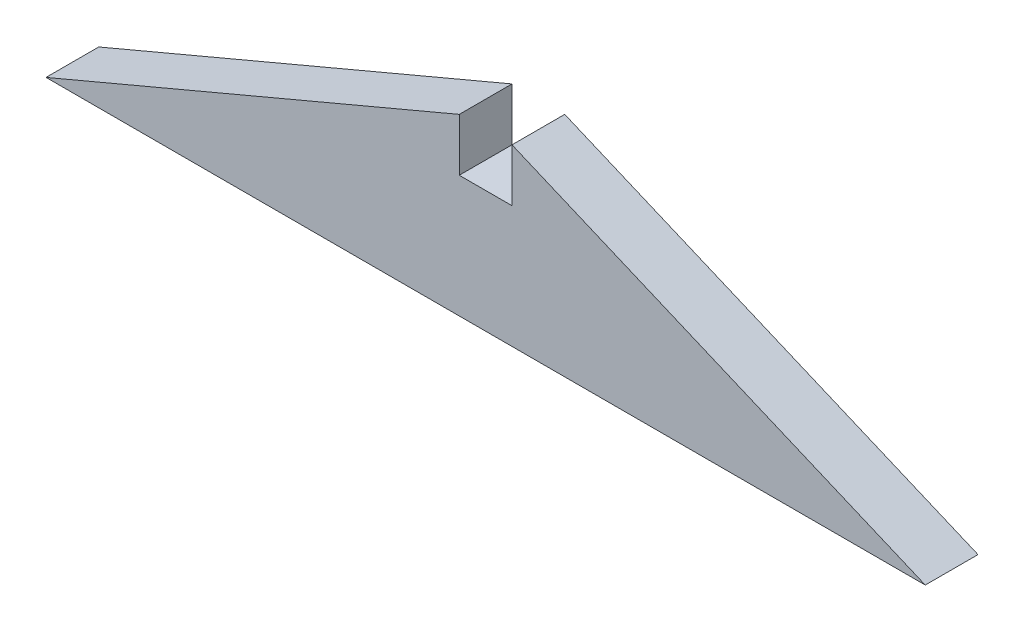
ISO-10303-21;
HEADER;
FILE_DESCRIPTION(('STEP AP214'),'2;1');
FILE_NAME('part.step','',(''),(''),'','','');
FILE_SCHEMA(('AUTOMOTIVE_DESIGN { 1 0 10303 214 1 1 1 1 }'));
ENDSEC;
DATA;
#1=APPLICATION_CONTEXT('core data for automotive mechanical design processes');
#2=APPLICATION_PROTOCOL_DEFINITION('international standard','automotive_design',2000,#1);
#3=PRODUCT_CONTEXT('',#1,'mechanical');
#4=PRODUCT('Part','Part','',(#3));
#5=PRODUCT_RELATED_PRODUCT_CATEGORY('part','',(#4));
#6=PRODUCT_DEFINITION_FORMATION('','',#4);
#7=PRODUCT_DEFINITION_CONTEXT('part definition',#1,'design');
#8=PRODUCT_DEFINITION('design','',#6,#7);
#9=PRODUCT_DEFINITION_SHAPE('','',#8);
#10=(LENGTH_UNIT() NAMED_UNIT(*) SI_UNIT(.MILLI.,.METRE.));
#11=(NAMED_UNIT(*) PLANE_ANGLE_UNIT() SI_UNIT($,.RADIAN.));
#12=(NAMED_UNIT(*) SI_UNIT($,.STERADIAN.) SOLID_ANGLE_UNIT());
#13=UNCERTAINTY_MEASURE_WITH_UNIT(LENGTH_MEASURE(1.E-05),#10,'distance_accuracy_value','');
#14=(GEOMETRIC_REPRESENTATION_CONTEXT(3) GLOBAL_UNCERTAINTY_ASSIGNED_CONTEXT((#13)) GLOBAL_UNIT_ASSIGNED_CONTEXT((#10,
#11,#12)) REPRESENTATION_CONTEXT('',''));
#15=CARTESIAN_POINT('',(0.,0.,0.));
#16=DIRECTION('',(0.,0.,1.));
#17=DIRECTION('',(1.,0.,0.));
#18=AXIS2_PLACEMENT_3D('',#15,#16,#17);
#19=CARTESIAN_POINT('',(12.6999999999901,-5.35843640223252E-13,25.4));
#20=DIRECTION('',(-1.,0.,0.));
#21=DIRECTION('',(0.,-1.,0.));
#22=AXIS2_PLACEMENT_3D('',#19,#20,#21);
#23=PLANE('',#22);
#24=DIRECTION('',(0.,1.,0.));
#25=VECTOR('',#24,1.);
#26=CARTESIAN_POINT('',(12.6999999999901,-5.35843640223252E-13,0.));
#27=LINE('',#26,#25);
#28=CARTESIAN_POINT('',(12.7000000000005,234.90945848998,0.));
#29=VERTEX_POINT('',#28);
#30=CARTESIAN_POINT('',(12.7000000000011,260.30945848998,0.));
#31=VERTEX_POINT('',#30);
#32=EDGE_CURVE('E121',#29,#31,#27,.T.);
#33=ORIENTED_EDGE('',*,*,#32,.F.);
#34=DIRECTION('',(0.,0.,-1.));
#35=VECTOR('',#34,1.);
#36=CARTESIAN_POINT('',(12.7000000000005,234.90945848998,25.4));
#37=LINE('',#36,#35);
#38=CARTESIAN_POINT('',(12.7000000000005,234.90945848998,25.4));
#39=VERTEX_POINT('',#38);
#40=EDGE_CURVE('E11',#39,#29,#37,.T.);
#41=ORIENTED_EDGE('',*,*,#40,.F.);
#42=DIRECTION('',(0.,1.,0.));
#43=VECTOR('',#42,1.);
#44=CARTESIAN_POINT('',(12.6999999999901,-5.35843640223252E-13,25.4));
#45=LINE('',#44,#43);
#46=CARTESIAN_POINT('',(12.7000000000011,260.30945848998,25.4));
#47=VERTEX_POINT('',#46);
#48=EDGE_CURVE('E134',#39,#47,#45,.T.);
#49=ORIENTED_EDGE('',*,*,#48,.T.);
#50=DIRECTION('',(0.,0.,-1.));
#51=VECTOR('',#50,1.);
#52=CARTESIAN_POINT('',(12.7000000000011,260.30945848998,25.4));
#53=LINE('',#52,#51);
#54=EDGE_CURVE('E83',#47,#31,#53,.T.);
#55=ORIENTED_EDGE('',*,*,#54,.T.);
#56=EDGE_LOOP('',(#33,#41,#49,#55));
#57=FACE_BOUND('',#56,.T.);
#58=ADVANCED_FACE('F39',(#57),#23,.T.);
#59=CARTESIAN_POINT('',(0.,234.90945848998,25.4));
#60=DIRECTION('',(0.,1.,0.));
#61=DIRECTION('',(0.,0.,1.));
#62=AXIS2_PLACEMENT_3D('',#59,#60,#61);
#63=PLANE('',#62);
#64=DIRECTION('',(1.,0.,0.));
#65=VECTOR('',#64,1.);
#66=CARTESIAN_POINT('',(0.,234.90945848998,0.));
#67=LINE('',#66,#65);
#68=CARTESIAN_POINT('',(-12.7000000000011,234.90945848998,0.));
#69=VERTEX_POINT('',#68);
#70=EDGE_CURVE('E124',#69,#29,#67,.T.);
#71=ORIENTED_EDGE('',*,*,#70,.F.);
#72=DIRECTION('',(0.,0.,-1.));
#73=VECTOR('',#72,1.);
#74=CARTESIAN_POINT('',(-12.7000000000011,234.90945848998,25.4));
#75=LINE('',#74,#73);
#76=CARTESIAN_POINT('',(-12.7000000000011,234.90945848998,25.4));
#77=VERTEX_POINT('',#76);
#78=EDGE_CURVE('E47',#77,#69,#75,.T.);
#79=ORIENTED_EDGE('',*,*,#78,.F.);
#80=DIRECTION('',(1.,0.,0.));
#81=VECTOR('',#80,1.);
#82=CARTESIAN_POINT('',(0.,234.90945848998,25.4));
#83=LINE('',#82,#81);
#84=EDGE_CURVE('E116',#77,#39,#83,.T.);
#85=ORIENTED_EDGE('',*,*,#84,.T.);
#86=ORIENTED_EDGE('',*,*,#40,.T.);
#87=EDGE_LOOP('',(#71,#79,#85,#86));
#88=FACE_BOUND('',#87,.T.);
#89=ADVANCED_FACE('F143',(#88),#63,.T.);
#90=CARTESIAN_POINT('',(-12.7000000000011,0.,25.4));
#91=DIRECTION('',(1.,0.,0.));
#92=DIRECTION('',(0.,0.,-1.));
#93=AXIS2_PLACEMENT_3D('',#90,#91,#92);
#94=PLANE('',#93);
#95=DIRECTION('',(0.,-1.,0.));
#96=VECTOR('',#95,1.);
#97=CARTESIAN_POINT('',(-12.7000000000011,0.,0.));
#98=LINE('',#97,#96);
#99=CARTESIAN_POINT('',(-12.7000000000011,260.30945848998,0.));
#100=VERTEX_POINT('',#99);
#101=EDGE_CURVE('E127',#100,#69,#98,.T.);
#102=ORIENTED_EDGE('',*,*,#101,.F.);
#103=DIRECTION('',(0.,0.,-1.));
#104=VECTOR('',#103,1.);
#105=CARTESIAN_POINT('',(-12.7000000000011,260.30945848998,25.4));
#106=LINE('',#105,#104);
#107=CARTESIAN_POINT('',(-12.7000000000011,260.30945848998,25.4));
#108=VERTEX_POINT('',#107);
#109=EDGE_CURVE('E104',#108,#100,#106,.T.);
#110=ORIENTED_EDGE('',*,*,#109,.F.);
#111=DIRECTION('',(0.,-1.,0.));
#112=VECTOR('',#111,1.);
#113=CARTESIAN_POINT('',(-12.7000000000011,0.,25.4));
#114=LINE('',#113,#112);
#115=EDGE_CURVE('E114',#108,#77,#114,.T.);
#116=ORIENTED_EDGE('',*,*,#115,.T.);
#117=ORIENTED_EDGE('',*,*,#78,.T.);
#118=EDGE_LOOP('',(#102,#110,#116,#117));
#119=FACE_BOUND('',#118,.T.);
#120=ADVANCED_FACE('F140',(#119),#94,.T.);
#121=CARTESIAN_POINT('',(-95.2514974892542,225.428544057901,25.4));
#122=DIRECTION('',(-0.389216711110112,0.921146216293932,0.));
#123=DIRECTION('',(-0.921146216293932,-0.389216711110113,0.));
#124=AXIS2_PLACEMENT_3D('',#121,#122,#123);
#125=PLANE('',#124);
#126=DIRECTION('',(0.921146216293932,0.389216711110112,0.));
#127=VECTOR('',#126,1.);
#128=CARTESIAN_POINT('',(-95.2514974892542,225.428544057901,0.));
#129=LINE('',#128,#127);
#130=CARTESIAN_POINT('',(-211.757031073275,176.200853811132,0.));
#131=VERTEX_POINT('',#130);
#132=EDGE_CURVE('E103',#131,#100,#129,.T.);
#133=ORIENTED_EDGE('',*,*,#132,.F.);
#134=DIRECTION('',(0.,0.,-1.));
#135=VECTOR('',#134,1.);
#136=CARTESIAN_POINT('',(-211.757031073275,176.200853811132,25.4));
#137=LINE('',#136,#135);
#138=CARTESIAN_POINT('',(-211.757031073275,176.200853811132,25.4));
#139=VERTEX_POINT('',#138);
#140=EDGE_CURVE('E97',#139,#131,#137,.T.);
#141=ORIENTED_EDGE('',*,*,#140,.F.);
#142=DIRECTION('',(0.921146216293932,0.389216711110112,0.));
#143=VECTOR('',#142,1.);
#144=CARTESIAN_POINT('',(-95.2514974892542,225.428544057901,25.4));
#145=LINE('',#144,#143);
#146=EDGE_CURVE('E101',#139,#108,#145,.T.);
#147=ORIENTED_EDGE('',*,*,#146,.T.);
#148=ORIENTED_EDGE('',*,*,#109,.T.);
#149=EDGE_LOOP('',(#133,#141,#147,#148));
#150=FACE_BOUND('',#149,.T.);
#151=ADVANCED_FACE('F99',(#150),#125,.T.);
#152=CARTESIAN_POINT('',(0.,176.200853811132,25.4));
#153=DIRECTION('',(0.,1.,0.));
#154=DIRECTION('',(0.,0.,1.));
#155=AXIS2_PLACEMENT_3D('',#152,#153,#154);
#156=PLANE('',#155);
#157=DIRECTION('',(1.,0.,0.));
#158=VECTOR('',#157,1.);
#159=CARTESIAN_POINT('',(0.,176.200853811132,0.));
#160=LINE('',#159,#158);
#161=CARTESIAN_POINT('',(211.757031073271,176.200853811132,0.));
#162=VERTEX_POINT('',#161);
#163=EDGE_CURVE('E76',#131,#162,#160,.T.);
#164=ORIENTED_EDGE('',*,*,#163,.T.);
#165=DIRECTION('',(0.,0.,-1.));
#166=VECTOR('',#165,1.);
#167=CARTESIAN_POINT('',(211.757031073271,176.200853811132,25.4));
#168=LINE('',#167,#166);
#169=CARTESIAN_POINT('',(211.757031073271,176.200853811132,25.4));
#170=VERTEX_POINT('',#169);
#171=EDGE_CURVE('E105',#170,#162,#168,.T.);
#172=ORIENTED_EDGE('',*,*,#171,.F.);
#173=DIRECTION('',(1.,0.,0.));
#174=VECTOR('',#173,1.);
#175=CARTESIAN_POINT('',(0.,176.200853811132,25.4));
#176=LINE('',#175,#174);
#177=EDGE_CURVE('E107',#139,#170,#176,.T.);
#178=ORIENTED_EDGE('',*,*,#177,.F.);
#179=ORIENTED_EDGE('',*,*,#140,.T.);
#180=EDGE_LOOP('',(#164,#172,#178,#179));
#181=FACE_BOUND('',#180,.T.);
#182=ADVANCED_FACE('F108',(#181),#156,.F.);
#183=CARTESIAN_POINT('',(95.2514974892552,225.4285440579,25.4));
#184=DIRECTION('',(-0.389216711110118,-0.92114621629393,0.));
#185=DIRECTION('',(0.92114621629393,-0.389216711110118,0.));
#186=AXIS2_PLACEMENT_3D('',#183,#184,#185);
#187=PLANE('',#186);
#188=DIRECTION('',(-0.92114621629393,0.389216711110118,0.));
#189=VECTOR('',#188,1.);
#190=CARTESIAN_POINT('',(95.2514974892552,225.4285440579,0.));
#191=LINE('',#190,#189);
#192=EDGE_CURVE('E132',#162,#31,#191,.T.);
#193=ORIENTED_EDGE('',*,*,#192,.T.);
#194=ORIENTED_EDGE('',*,*,#54,.F.);
#195=DIRECTION('',(-0.92114621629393,0.389216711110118,0.));
#196=VECTOR('',#195,1.);
#197=CARTESIAN_POINT('',(95.2514974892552,225.4285440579,25.4));
#198=LINE('',#197,#196);
#199=EDGE_CURVE('E55',#170,#47,#198,.T.);
#200=ORIENTED_EDGE('',*,*,#199,.F.);
#201=ORIENTED_EDGE('',*,*,#171,.T.);
#202=EDGE_LOOP('',(#193,#194,#200,#201));
#203=FACE_BOUND('',#202,.T.);
#204=ADVANCED_FACE('F148',(#203),#187,.F.);
#205=CARTESIAN_POINT('',(0.,0.,25.4));
#206=DIRECTION('',(0.,0.,1.));
#207=DIRECTION('',(1.,0.,0.));
#208=AXIS2_PLACEMENT_3D('',#205,#206,#207);
#209=PLANE('',#208);
#210=ORIENTED_EDGE('',*,*,#48,.F.);
#211=ORIENTED_EDGE('',*,*,#84,.F.);
#212=ORIENTED_EDGE('',*,*,#115,.F.);
#213=ORIENTED_EDGE('',*,*,#146,.F.);
#214=ORIENTED_EDGE('',*,*,#177,.T.);
#215=ORIENTED_EDGE('',*,*,#199,.T.);
#216=EDGE_LOOP('',(#210,#211,#212,#213,#214,#215));
#217=FACE_BOUND('',#216,.T.);
#218=ADVANCED_FACE('F111',(#217),#209,.T.);
#219=CARTESIAN_POINT('',(0.,0.,0.));
#220=DIRECTION('',(0.,0.,1.));
#221=DIRECTION('',(1.,0.,0.));
#222=AXIS2_PLACEMENT_3D('',#219,#220,#221);
#223=PLANE('',#222);
#224=ORIENTED_EDGE('',*,*,#32,.T.);
#225=ORIENTED_EDGE('',*,*,#192,.F.);
#226=ORIENTED_EDGE('',*,*,#163,.F.);
#227=ORIENTED_EDGE('',*,*,#132,.T.);
#228=ORIENTED_EDGE('',*,*,#101,.T.);
#229=ORIENTED_EDGE('',*,*,#70,.T.);
#230=EDGE_LOOP('',(#224,#225,#226,#227,#228,#229));
#231=FACE_BOUND('',#230,.T.);
#232=ADVANCED_FACE('F145',(#231),#223,.F.);
#233=CLOSED_SHELL('',(#58,#89,#120,#151,#182,#204,#218,#232));
#234=MANIFOLD_SOLID_BREP('B2',#233);
#235=ADVANCED_BREP_SHAPE_REPRESENTATION('',(#18,#234),#14);
#236=SHAPE_DEFINITION_REPRESENTATION(#9,#235);
ENDSEC;
END-ISO-10303-21;
